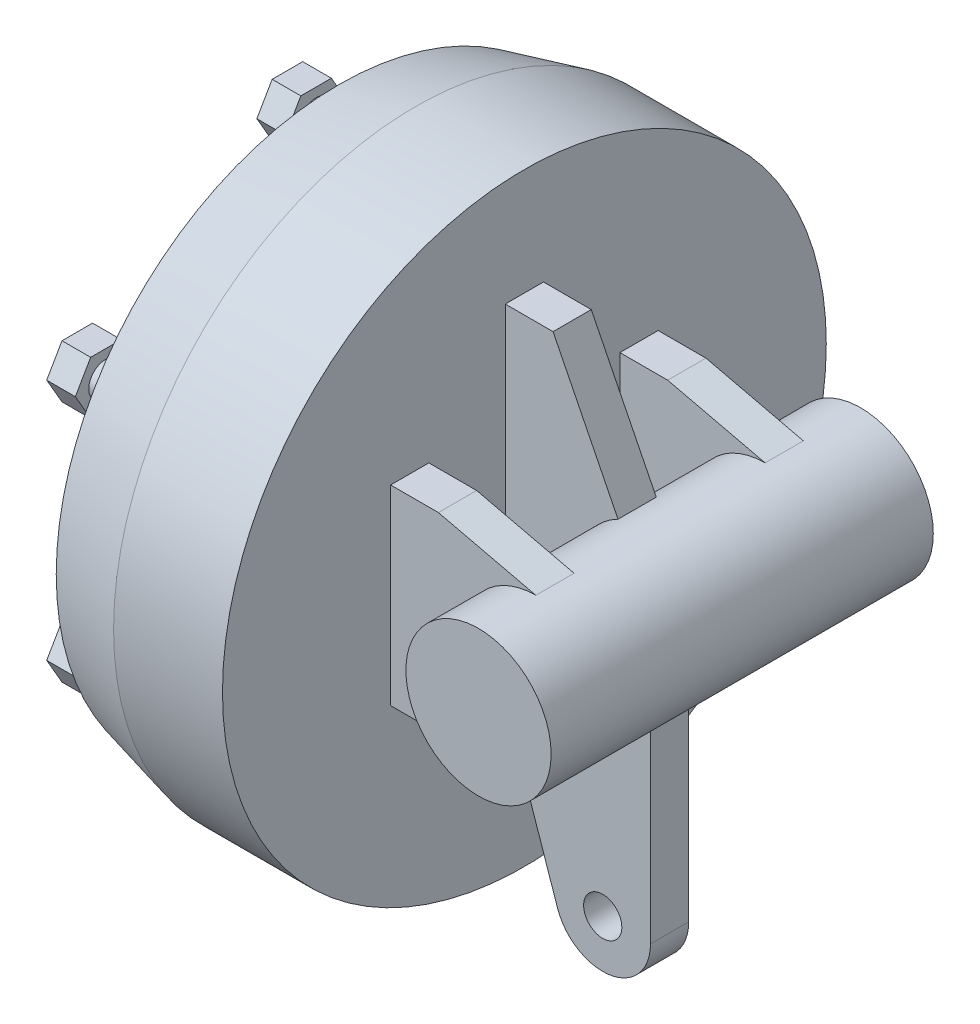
from build123d import *

# Parameters (mm, degrees)
BOSS_EXTRUDE1_DEPTH      = 100
BOSS_EXTRUDE1_DEPTH_BACK = 100
SKETCH2_R                = 38
BOSS_EXTRUDE2_START      = 50
BOSS_EXTRUDE2_DEPTH      = 20
BOSS_EXTRUDE3_DEPTH      = 10
BOSS_EXTRUDE3_DEPTH_BACK = 10
CUT_EXTRUDE1_REACH       = 285.651
SKETCH5_R                = 10
SKETCH6_R                = 9
BOSS_EXTRUDE4_DEPTH      = 30
BOSS_EXTRUDE5_START      = -3
BOSS_EXTRUDE5_DEPTH      = 15
BOSS_EXTRUDE6_DEPTH      = 9
CIRPATTERN1_COUNT        = 6
CIRPATTERN2_COUNT        = 6


with BuildPart() as part:
    # Sketch1 → Revolve1 (revolve)
    with BuildSketch(Plane.XY, mode=Mode.PRIVATE) as revolve1_sk:
        Polygon((0, 0), (0, 158), (-57, 158), (-97, 148), (-97, 76), (-122, 76), (-122, 50), (-147, 50), (-147, 0), align=None)
    revolve(revolve1_sk.sketch.rotate(Axis((-147, 0, 0), (1, 0, 0)), 90), axis=Axis((-147, 0, 0), (1, 0, 0)))



with BuildPart() as body_2:
    # Sketch2 → Boss-Extrude1 (new, two sides: drawn at the far end of the back side and taken through both)
    with BuildSketch(Plane.XY.offset(-BOSS_EXTRUDE1_DEPTH_BACK)):
        with Locations((76, 0)):
            Circle(SKETCH2_R)
    extrude(amount=BOSS_EXTRUDE1_DEPTH + BOSS_EXTRUDE1_DEPTH_BACK)


with BuildPart() as part_1:
    add(part.part)

    add(body_2.part)  # Boss-Extrude2 merges body 2
    # Sketch3 → Boss-Extrude2 (add)
    with BuildSketch(Plane.XY.offset(BOSS_EXTRUDE2_START)):
        Polygon((0, -50), (0, 50), (25, 50), (76, 38), (76, -38), (25, -50), align=None)
    boss_extrude2 = extrude(amount=BOSS_EXTRUDE2_DEPTH)

    # Mirror1: Boss-Extrude2 across plane
    add(boss_extrude2.mirror(Plane.XY))

    # Sketch4 → Boss-Extrude3 (add, two sides: drawn at the far end of the back side and taken through both)
    with BuildSketch(Plane.XY.offset(-BOSS_EXTRUDE3_DEPTH_BACK)):
        with BuildLine():
            Line((0, 102), (25, 102))
            Line((25, 102), (76, 0))
            Line((76, 0), (76, -150))
            ThreePointArc((76, -150), (55.094223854, -174.662468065), (27.341013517, -158.077893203))
            Line((27.341013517, -158.077893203), (0, -78))
            Line((0, -78), (0, 102))
        make_face()
    extrude(amount=BOSS_EXTRUDE3_DEPTH + BOSS_EXTRUDE3_DEPTH_BACK)

    # Sketch5 → Cut-Extrude1 (cut, up to next)
    with BuildSketch(Plane.XY.offset(10), mode=Mode.PRIVATE) as cut_extrude1_sk1:
        with Locations((51, -150)):
            Circle(SKETCH5_R)
    cut_extrude1_tool1 = extrude(cut_extrude1_sk1.sketch, amount=-CUT_EXTRUDE1_REACH, mode=Mode.PRIVATE) & part_1.part
    add(cut_extrude1_tool1.solids().sort_by_distance((51, -150, 10))[0], mode=Mode.SUBTRACT)

    # Sketch6 → Boss-Extrude4 (add)
    with BuildSketch(Plane.ZY.offset(97)):
        with Locations(Location((0, 127, 0), (0, 0, 180))):
            Circle(SKETCH6_R)
    boss_extrude4 = extrude(amount=BOSS_EXTRUDE4_DEPTH)

    # Sketch7 → Boss-Extrude5 (add)
    with BuildSketch(Plane.ZY.offset(127).offset(BOSS_EXTRUDE5_START)):
        Polygon((16, 127), (8, 140.856406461), (-8, 140.856406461), (-16, 127), (-8, 113.143593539), (8, 113.143593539), align=None)
    boss_extrude5 = extrude(amount=-BOSS_EXTRUDE5_DEPTH)

    # Sketch8 → Boss-Extrude6 (add)
    with BuildSketch(Plane.ZY.offset(122)):
        Polygon((7, 60), (3.5, 66.062177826), (-3.5, 66.062177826), (-7, 60), (-3.5, 53.937822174), (3.5, 53.937822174), align=None)
    boss_extrude6 = extrude(amount=BOSS_EXTRUDE6_DEPTH)

    # CirPattern1: Boss-Extrude4, Boss-Extrude5 ×6 about axis
    cirpattern1_axis = Axis((0, 0, 0), (1, 0, 0))
    add([boss_extrude4.rotate(cirpattern1_axis, i * 360 / CIRPATTERN1_COUNT) for i in range(1, CIRPATTERN1_COUNT)])
    add([boss_extrude5.rotate(cirpattern1_axis, i * 360 / CIRPATTERN1_COUNT) for i in range(1, CIRPATTERN1_COUNT)])

    # CirPattern2: Boss-Extrude6 ×6 about axis
    cirpattern2_axis = Axis((0, 0, 0), (1, 0, 0))
    for i in range(1, CIRPATTERN2_COUNT):
        add(boss_extrude6.rotate(cirpattern2_axis, i * 360 / CIRPATTERN2_COUNT))


solid = part_1.part
